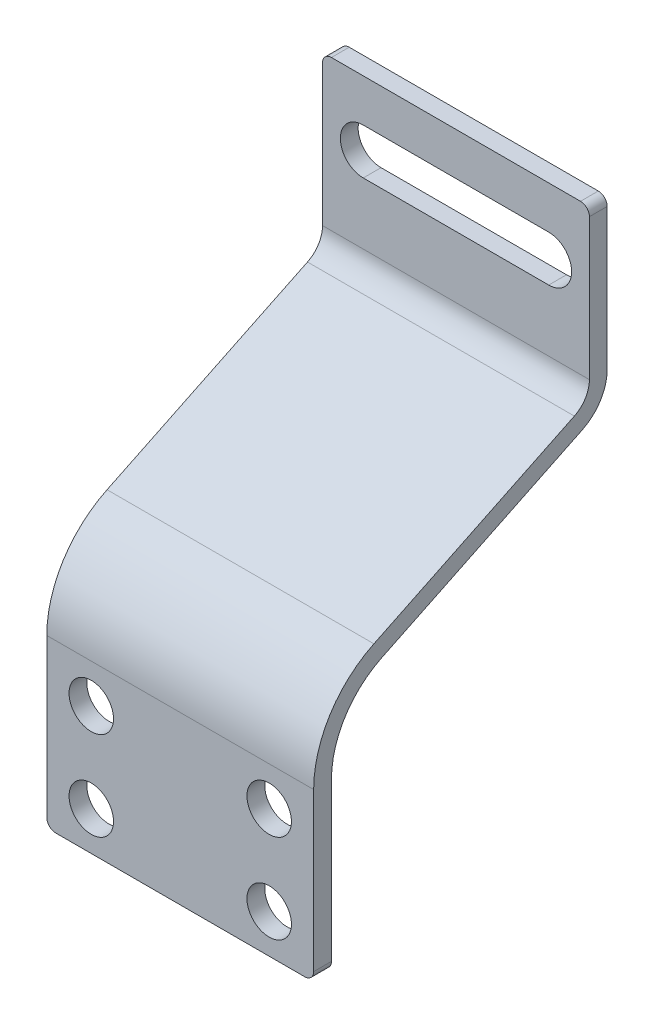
from build123d import *

# Parameters (mm, degrees)
BOSS_EXTRUDE1_DEPTH = 30
SKETCH2_R           = 5
CUT_EXTRUDE1_DEPTH  = 40
CUT_EXTRUDE2_DEPTH  = 40
FILLET1_R           = 2


with BuildPart() as part:
    # Sketch1 → Boss-Extrude1 (new, symmetric)
    with BuildSketch(Plane(origin=(0, 0, 0), x_dir=(0, 0, -1), z_dir=(1, 0, 0))):
        with BuildLine():
            Line((-2, 40), (2, 40))
            Line((2, 40), (2, 6.270435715))
            ThreePointArc((2, 6.270435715), (0.472192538, 0.958001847), (-3.644390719, -2.731156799))
            Line((-3.644390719, -2.731156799), (-48.711218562, -24.537686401))
            ThreePointArc((-48.711218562, -24.537686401), (-56.944385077, -31.916003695), (-60, -42.540871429))
            Line((-60, -42.540871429), (-60, -80))
            Line((-60, -80), (-64, -80))
            Line((-64, -80), (-64, -42.540871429))
            ThreePointArc((-64, -42.540871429), (-60.333262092, -29.791030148), (-50.453462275, -20.937049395))
            Line((-50.453462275, -20.937049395), (-5.386634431, 0.869480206))
            ThreePointArc((-5.386634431, 0.869480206), (-2.916684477, 3.082975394), (-2, 6.270435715))
            Line((-2, 6.270435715), (-2, 40))
        make_face()
    extrude(amount=BOSS_EXTRUDE1_DEPTH, both=True)

    # Sketch2 → Cut-Extrude1 (cut)
    with BuildSketch(Plane.XY.offset(64)):
        with Locations((-20, -51.270435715)):
            Circle(SKETCH2_R)
        with Locations((20, -51.270435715)):
            Circle(SKETCH2_R)
        with Locations((20, -71.270435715)):
            Circle(SKETCH2_R)
        with Locations((-20, -71.270435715)):
            Circle(SKETCH2_R)
    extrude(amount=-CUT_EXTRUDE1_DEPTH, mode=Mode.SUBTRACT)

    # Sketch3 → Cut-Extrude2 (cut)
    with BuildSketch(Plane.XY.offset(2)):
        with BuildLine():
            Line((-20.85, 30.419247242), (20.85, 30.419247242))
            ThreePointArc((20.85, 30.419247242), (26, 25.269247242), (20.85, 20.119247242))
            Line((20.85, 20.119247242), (-20.85, 20.119247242))
            ThreePointArc((-20.85, 20.119247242), (-26, 25.269247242), (-20.85, 30.419247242))
        make_face()
    extrude(amount=-CUT_EXTRUDE2_DEPTH, mode=Mode.SUBTRACT)

    # Fillet1
    fillet1_edges = [part.edges().sort_by_distance(p)[0] for p in [
        (-30, -80, 62),
        (-30, 40, 0),
        (30, -80, 62),
        (30, 40, 0),
    ]]
    fillet(fillet1_edges, radius=FILLET1_R)


solid = part.part
